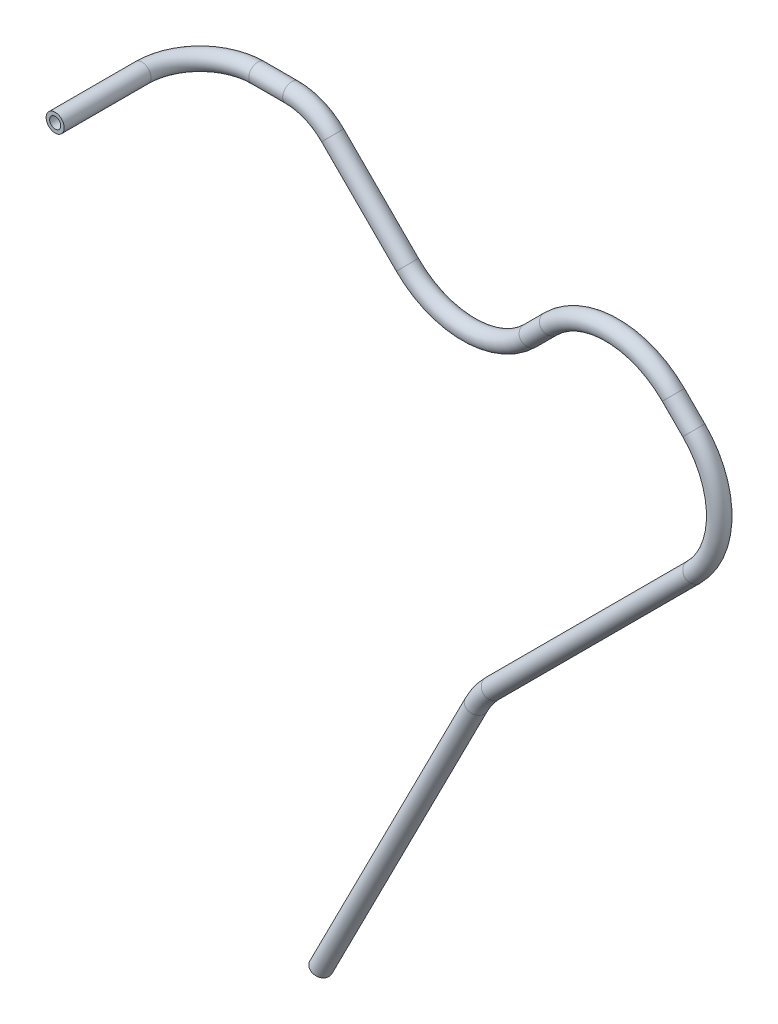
from build123d import *

# Parameters (mm, degrees)
SKETCH1_R   = 7.9375
SKETCH1_R_2 = 4.8641


with BuildPart() as part:
    # Sweep1: sweep along a curve in space
    with BuildLine() as sweep1_path:
        Line((0, 0, 0), (0, 0, -76.2))
        ThreePointArc((50.8, 0, -127), (14.878975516, 0, -112.121024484), (0, 0, -76.2))
        Line((50.8, 0, -127), (80.557951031, 0, -127))
        ThreePointArc((116.478975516, -14.878975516, -127), (99.998269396, -3.866919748, -127), (80.557951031, 0, -127))
        Line((116.478975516, -14.878975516, -127), (182.058368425, -80.458368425, -127))
        ThreePointArc((289.821441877, -80.458368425, -127), (235.939905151, -102.776831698, -127), (182.058368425, -80.458368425, -127))
        Line((289.821441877, -80.458368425, -127), (307.667394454, -62.612415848, -127))
        ThreePointArc((415.430467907, -62.612415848, -127), (361.548931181, -40.293952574, -127), (307.667394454, -62.612415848, -127))
        Line((415.430467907, -62.612415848, -127), (433.390980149, -80.57292809, -127))
        ThreePointArc((433.390980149, -188.336001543, -127), (455.709443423, -134.454464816, -127), (433.390980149, -80.57292809, -127))
        Line((433.390980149, -188.336001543, -127), (256.577806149, -365.149175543, -127))
        ThreePointArc((256.577806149, -365.149175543, -127), (248.810041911, -374.244512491, -127), (242.56123824, -384.443324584, -127))
        Line((242.56123824, -384.443324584, -127), (106.147219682, -652.236122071, -127))
    # Sketch1 → Sweep1 (sweep)
    with BuildSketch(Plane.XY):
        Circle(SKETCH1_R)
        Circle(SKETCH1_R_2, mode=Mode.SUBTRACT)
    sweep(path=sweep1_path.line)


solid = part.part
